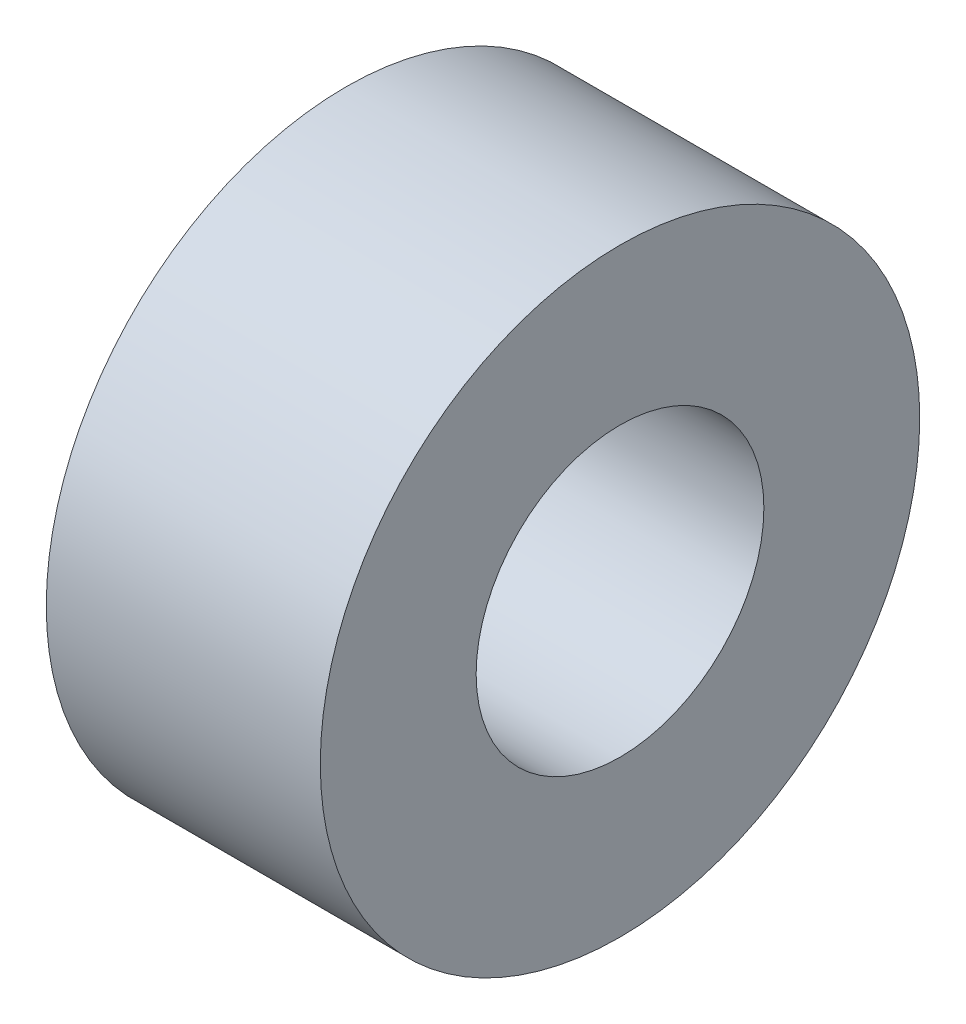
from build123d import *

# Parameters (mm, degrees)
ESQUISSE1_W = 8
ESQUISSE1_H = 4.55


with BuildPart() as part:
    # Esquisse1 → Base-R_volution (revolve)
    with BuildSketch(Plane(origin=(0, 0, 0), x_dir=(1, 0, 0), z_dir=(0, 1, 0)), mode=Mode.PRIVATE) as base_r_volution_sk:
        with Locations((4, 6.475)):
            Rectangle(ESQUISSE1_W, ESQUISSE1_H)
    revolve(base_r_volution_sk.sketch.rotate(Axis((0, 0, 0), (1, 0, 0)), 180), axis=Axis((0, 0, 0), (1, 0, 0)))


solid = part.part
